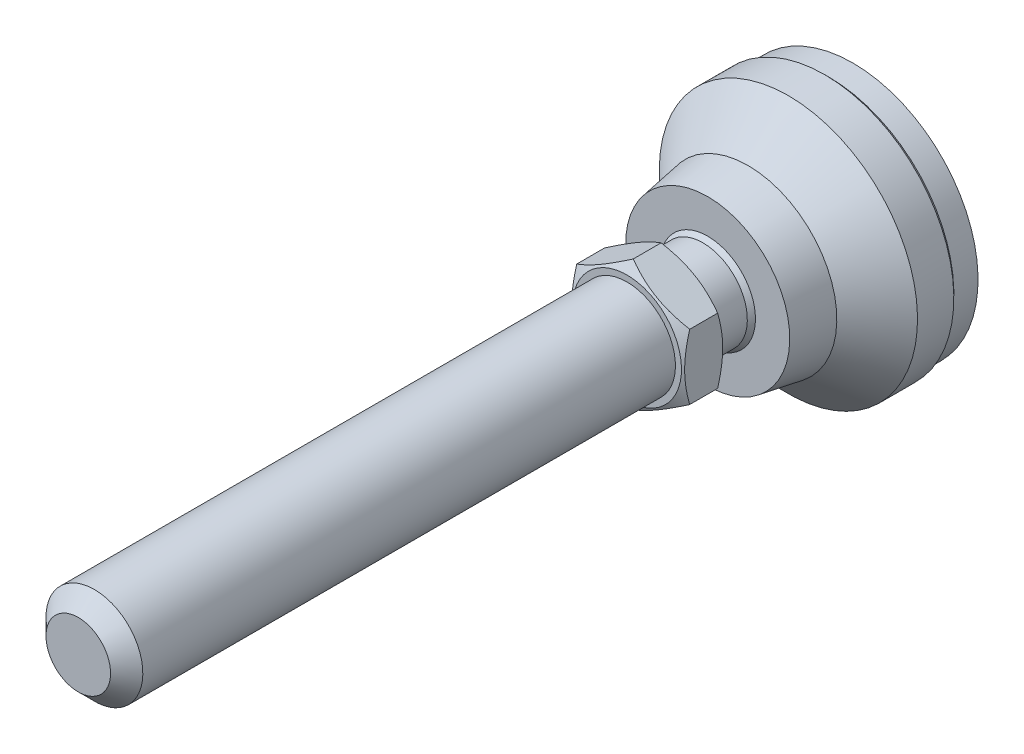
ISO-10303-21;
HEADER;
FILE_DESCRIPTION(('STEP AP214'),'2;1');
FILE_NAME('part.step','',(''),(''),'','','');
FILE_SCHEMA(('AUTOMOTIVE_DESIGN { 1 0 10303 214 1 1 1 1 }'));
ENDSEC;
DATA;
#1=APPLICATION_CONTEXT('core data for automotive mechanical design processes');
#2=APPLICATION_PROTOCOL_DEFINITION('international standard','automotive_design',2000,#1);
#3=PRODUCT_CONTEXT('',#1,'mechanical');
#4=PRODUCT('Part','Part','',(#3));
#5=PRODUCT_RELATED_PRODUCT_CATEGORY('part','',(#4));
#6=PRODUCT_DEFINITION_FORMATION('','',#4);
#7=PRODUCT_DEFINITION_CONTEXT('part definition',#1,'design');
#8=PRODUCT_DEFINITION('design','',#6,#7);
#9=PRODUCT_DEFINITION_SHAPE('','',#8);
#10=(LENGTH_UNIT() NAMED_UNIT(*) SI_UNIT(.MILLI.,.METRE.));
#11=(NAMED_UNIT(*) PLANE_ANGLE_UNIT() SI_UNIT($,.RADIAN.));
#12=(NAMED_UNIT(*) SI_UNIT($,.STERADIAN.) SOLID_ANGLE_UNIT());
#13=UNCERTAINTY_MEASURE_WITH_UNIT(LENGTH_MEASURE(1.E-05),#10,'distance_accuracy_value','');
#14=(GEOMETRIC_REPRESENTATION_CONTEXT(3) GLOBAL_UNCERTAINTY_ASSIGNED_CONTEXT((#13)) GLOBAL_UNIT_ASSIGNED_CONTEXT((#10,
#11,#12)) REPRESENTATION_CONTEXT('',''));
#15=CARTESIAN_POINT('',(0.,0.,0.));
#16=DIRECTION('',(0.,0.,1.));
#17=DIRECTION('',(1.,0.,0.));
#18=AXIS2_PLACEMENT_3D('',#15,#16,#17);
#19=CARTESIAN_POINT('',(0.,0.,3.));
#20=DIRECTION('',(0.,0.,-1.));
#21=DIRECTION('',(0.,1.,0.));
#22=AXIS2_PLACEMENT_3D('',#19,#20,#21);
#23=CYLINDRICAL_SURFACE('',#22,5.50000000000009);
#24=CARTESIAN_POINT('',(0.,0.,22.9999999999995));
#25=DIRECTION('',(0.,0.,-1.));
#26=DIRECTION('',(0.,1.,0.));
#27=AXIS2_PLACEMENT_3D('',#24,#25,#26);
#28=CIRCLE('',#27,5.50000000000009);
#29=CARTESIAN_POINT('',(0.,5.50000000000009,22.9999999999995));
#30=VERTEX_POINT('',#29);
#31=EDGE_CURVE('E112',#30,#30,#28,.T.);
#32=ORIENTED_EDGE('',*,*,#31,.T.);
#33=EDGE_LOOP('',(#32));
#34=FACE_BOUND('',#33,.T.);
#35=CARTESIAN_POINT('',(0.,0.,18.5902313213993));
#36=DIRECTION('',(0.,0.,-1.));
#37=DIRECTION('',(0.,1.,0.));
#38=AXIS2_PLACEMENT_3D('',#35,#36,#37);
#39=CIRCLE('',#38,5.50000000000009);
#40=CARTESIAN_POINT('',(-5.50000000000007,0.,18.5902313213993));
#41=VERTEX_POINT('',#40);
#42=EDGE_CURVE('E284',#41,#41,#39,.T.);
#43=ORIENTED_EDGE('',*,*,#42,.F.);
#44=EDGE_LOOP('',(#43));
#45=FACE_BOUND('',#44,.T.);
#46=ADVANCED_FACE('F14',(#34,#45),#23,.T.);
#47=CARTESIAN_POINT('',(0.,0.,14.2601043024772));
#48=DIRECTION('',(0.,0.,-1.));
#49=DIRECTION('',(-1.,0.,0.));
#50=AXIS2_PLACEMENT_3D('',#47,#48,#49);
#51=SPHERICAL_SURFACE('',#50,7.);
#52=CARTESIAN_POINT('',(0.,0.,18.));
#53=DIRECTION('',(0.,0.,-1.));
#54=DIRECTION('',(0.,1.,0.));
#55=AXIS2_PLACEMENT_3D('',#52,#53,#54);
#56=CIRCLE('',#55,5.91719360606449);
#57=CARTESIAN_POINT('',(-5.91719360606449,0.,18.));
#58=VERTEX_POINT('',#57);
#59=EDGE_CURVE('E115',#58,#58,#56,.T.);
#60=CARTESIAN_POINT('',(-5.50000000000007,0.,18.5902313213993));
#61=CARTESIAN_POINT('',(-5.50465946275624,0.,18.5843130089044));
#62=CARTESIAN_POINT('',(-5.50930937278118,0.,18.5783871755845));
#63=CARTESIAN_POINT('',(-5.51859003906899,0.,18.5665205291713));
#64=CARTESIAN_POINT('',(-5.52322079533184,0.,18.5605797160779));
#65=CARTESIAN_POINT('',(-5.53246310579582,0.,18.5486831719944));
#66=CARTESIAN_POINT('',(-5.53707465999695,0.,18.5427274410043));
#67=CARTESIAN_POINT('',(-5.54627851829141,0.,18.5308011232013));
#68=CARTESIAN_POINT('',(-5.55087082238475,0.,18.5248305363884));
#69=CARTESIAN_POINT('',(-5.56003613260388,0.,18.5128745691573));
#70=CARTESIAN_POINT('',(-5.56460913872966,0.,18.5068891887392));
#71=CARTESIAN_POINT('',(-5.57373580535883,0.,18.4949036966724));
#72=CARTESIAN_POINT('',(-5.57828946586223,0.,18.4889035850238));
#73=CARTESIAN_POINT('',(-5.58737739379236,0.,18.4768886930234));
#74=CARTESIAN_POINT('',(-5.59191166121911,0.,18.4708739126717));
#75=CARTESIAN_POINT('',(-5.60096075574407,0.,18.4588297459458));
#76=CARTESIAN_POINT('',(-5.60547558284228,0.,18.4528003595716));
#77=CARTESIAN_POINT('',(-5.6144857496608,0.,18.4407270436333));
#78=CARTESIAN_POINT('',(-5.61898108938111,0.,18.4346831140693));
#79=CARTESIAN_POINT('',(-5.62795223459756,0.,18.4225807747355));
#80=CARTESIAN_POINT('',(-5.6324280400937,0.,18.4165223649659));
#81=CARTESIAN_POINT('',(-5.64136007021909,0.,18.4043911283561));
#82=CARTESIAN_POINT('',(-5.64581629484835,0.,18.398318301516));
#83=CARTESIAN_POINT('',(-5.65470911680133,0.,18.3861582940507));
#84=CARTESIAN_POINT('',(-5.65914571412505,0.,18.3800711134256));
#85=CARTESIAN_POINT('',(-5.66799923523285,0.,18.3678824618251));
#86=CARTESIAN_POINT('',(-5.67241615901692,0.,18.3617809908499));
#87=CARTESIAN_POINT('',(-5.68123028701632,0.,18.3495638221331));
#88=CARTESIAN_POINT('',(-5.68562749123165,0.,18.3434481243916));
#89=CARTESIAN_POINT('',(-5.69440213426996,0.,18.3312025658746));
#90=CARTESIAN_POINT('',(-5.69877957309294,0.,18.3250727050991));
#91=CARTESIAN_POINT('',(-5.70751463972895,0.,18.3127988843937));
#92=CARTESIAN_POINT('',(-5.71187226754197,0.,18.3066549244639));
#93=CARTESIAN_POINT('',(-5.72056766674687,0.,18.2943529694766));
#94=CARTESIAN_POINT('',(-5.72490543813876,0.,18.2881949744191));
#95=CARTESIAN_POINT('',(-5.73356107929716,0.,18.2758650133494));
#96=CARTESIAN_POINT('',(-5.73787894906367,0.,18.2696930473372));
#97=CARTESIAN_POINT('',(-5.74649474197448,0.,18.2573352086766));
#98=CARTESIAN_POINT('',(-5.75079266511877,0.,18.2511493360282));
#99=CARTESIAN_POINT('',(-5.75936851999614,0.,18.2387637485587));
#100=CARTESIAN_POINT('',(-5.76364645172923,0.,18.2325640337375));
#101=CARTESIAN_POINT('',(-5.77218227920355,0.,18.2201508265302));
#102=CARTESIAN_POINT('',(-5.77644017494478,0.,18.2139373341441));
#103=CARTESIAN_POINT('',(-5.78493588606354,0.,18.2014966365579));
#104=CARTESIAN_POINT('',(-5.78917370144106,0.,18.195269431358));
#105=CARTESIAN_POINT('',(-5.79762920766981,0.,18.1828013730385));
#106=CARTESIAN_POINT('',(-5.80184689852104,0.,18.1765605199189));
#107=CARTESIAN_POINT('',(-5.81026211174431,0.,18.1640652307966));
#108=CARTESIAN_POINT('',(-5.81445963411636,0.,18.1578107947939));
#109=CARTESIAN_POINT('',(-5.82283446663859,0.,18.1452884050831));
#110=CARTESIAN_POINT('',(-5.82701177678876,0.,18.1390204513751));
#111=CARTESIAN_POINT('',(-5.83534614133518,0.,18.1264710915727));
#112=CARTESIAN_POINT('',(-5.83950319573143,0.,18.1201896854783));
#113=CARTESIAN_POINT('',(-5.84779700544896,0.,18.107613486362));
#114=CARTESIAN_POINT('',(-5.85193376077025,0.,18.1013186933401));
#115=CARTESIAN_POINT('',(-5.86018692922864,0.,18.0887157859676));
#116=CARTESIAN_POINT('',(-5.86430334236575,0.,18.082407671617));
#117=CARTESIAN_POINT('',(-5.87251578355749,0.,18.0697781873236));
#118=CARTESIAN_POINT('',(-5.87661181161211,0.,18.063456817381));
#119=CARTESIAN_POINT('',(-5.88478343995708,0.,18.0508008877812));
#120=CARTESIAN_POINT('',(-5.88885904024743,0.,18.044466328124));
#121=CARTESIAN_POINT('',(-5.89698977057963,0.,18.0317840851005));
#122=CARTESIAN_POINT('',(-5.90104490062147,0.,18.0254364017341));
#123=CARTESIAN_POINT('',(-5.909134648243,0.,18.0127279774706));
#124=CARTESIAN_POINT('',(-5.91316926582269,0.,18.0063672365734));
#125=CARTESIAN_POINT('',(-5.91719360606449,0.,18.));
#126=B_SPLINE_CURVE_WITH_KNOTS('',3,(#60,#61,#62,#63,#64,#65,#66,#67,#68,#69,#70,#71,#72,#73,
#74,#75,#76,#77,#78,#79,#80,#81,#82,#83,#84,#85,#86,#87,#88,#89,#90,#91,#92,#93,#94,#95,#96,#97,
#98,#99,#100,#101,#102,#103,#104,#105,#106,#107,#108,#109,#110,#111,#112,#113,#114,#115,#116,
#117,#118,#119,#120,#121,#122,#123,#124,#125),.UNSPECIFIED.,.F.,.F.,(4,2,2,2,2,2,2,2,2,2,2,2,2,
2,2,2,2,2,2,2,2,2,2,2,2,2,2,2,2,2,2,2,4),(0.,0.0225971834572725,0.0451943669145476,
0.067791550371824,0.0903887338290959,0.112985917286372,0.135583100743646,0.158180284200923,
0.180777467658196,0.203374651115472,0.225971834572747,0.24856901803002,0.271166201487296,
0.293763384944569,0.316360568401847,0.338957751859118,0.361554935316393,0.384152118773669,
0.406749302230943,0.429346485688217,0.451943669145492,0.474540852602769,0.49713803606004,
0.519735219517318,0.542332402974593,0.564929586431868,0.587526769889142,0.610123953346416,
0.632721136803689,0.655318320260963,0.67791550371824,0.700512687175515,0.723109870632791),.UNSPECIFIED.);
#127=EDGE_CURVE('BSEAM243',#41,#58,#126,.T.);
#128=ORIENTED_EDGE('',*,*,#42,.T.);
#129=ORIENTED_EDGE('',*,*,#59,.F.);
#130=ORIENTED_EDGE('',*,*,#127,.T.);
#131=ORIENTED_EDGE('',*,*,#127,.F.);
#132=EDGE_LOOP('',(#128,#130,#129,#131));
#133=FACE_BOUND('',#132,.T.);
#134=ADVANCED_FACE('F243',(#133),#51,.T.);
#135=CARTESIAN_POINT('',(0.,0.,3.5));
#136=DIRECTION('',(0.,0.,1.));
#137=DIRECTION('',(0.,-1.,0.));
#138=AXIS2_PLACEMENT_3D('',#135,#136,#137);
#139=CONICAL_SURFACE('',#138,16.,0.785398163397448);
#140=CARTESIAN_POINT('',(0.,0.,3.));
#141=DIRECTION('',(0.,0.,-1.));
#142=DIRECTION('',(0.,1.,0.));
#143=AXIS2_PLACEMENT_3D('',#140,#141,#142);
#144=CIRCLE('',#143,15.5);
#145=CARTESIAN_POINT('',(0.,15.5,3.));
#146=VERTEX_POINT('',#145);
#147=EDGE_CURVE('E85',#146,#146,#144,.T.);
#148=ORIENTED_EDGE('',*,*,#147,.F.);
#149=EDGE_LOOP('',(#148));
#150=FACE_BOUND('',#149,.T.);
#151=CARTESIAN_POINT('',(0.,0.,3.5));
#152=DIRECTION('',(0.,0.,-1.));
#153=DIRECTION('',(0.,1.,0.));
#154=AXIS2_PLACEMENT_3D('',#151,#152,#153);
#155=CIRCLE('',#154,16.);
#156=CARTESIAN_POINT('',(0.,16.,3.5));
#157=VERTEX_POINT('',#156);
#158=EDGE_CURVE('E88',#157,#157,#155,.T.);
#159=ORIENTED_EDGE('',*,*,#158,.T.);
#160=EDGE_LOOP('',(#159));
#161=FACE_BOUND('',#160,.T.);
#162=ADVANCED_FACE('F246',(#150,#161),#139,.T.);
#163=CARTESIAN_POINT('',(0.,0.,3.));
#164=DIRECTION('',(0.,0.,-1.));
#165=DIRECTION('',(0.,1.,0.));
#166=AXIS2_PLACEMENT_3D('',#163,#164,#165);
#167=CYLINDRICAL_SURFACE('',#166,16.);
#168=ORIENTED_EDGE('',*,*,#158,.F.);
#169=EDGE_LOOP('',(#168));
#170=FACE_BOUND('',#169,.T.);
#171=CARTESIAN_POINT('',(0.,0.,8.00000000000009));
#172=DIRECTION('',(0.,0.,-1.));
#173=DIRECTION('',(0.,1.,0.));
#174=AXIS2_PLACEMENT_3D('',#171,#172,#173);
#175=CIRCLE('',#174,16.);
#176=CARTESIAN_POINT('',(0.,16.,8.00000000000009));
#177=VERTEX_POINT('',#176);
#178=EDGE_CURVE('E105',#177,#177,#175,.T.);
#179=ORIENTED_EDGE('',*,*,#178,.T.);
#180=EDGE_LOOP('',(#179));
#181=FACE_BOUND('',#180,.T.);
#182=ADVANCED_FACE('F392',(#170,#181),#167,.T.);
#183=CARTESIAN_POINT('',(0.,0.,13.));
#184=DIRECTION('',(0.,0.,-1.));
#185=DIRECTION('',(0.,1.,0.));
#186=AXIS2_PLACEMENT_3D('',#183,#184,#185);
#187=CONICAL_SURFACE('',#186,11.,0.785398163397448);
#188=ORIENTED_EDGE('',*,*,#178,.F.);
#189=EDGE_LOOP('',(#188));
#190=FACE_BOUND('',#189,.T.);
#191=CARTESIAN_POINT('',(0.,0.,13.));
#192=DIRECTION('',(0.,0.,-1.));
#193=DIRECTION('',(0.,1.,0.));
#194=AXIS2_PLACEMENT_3D('',#191,#192,#193);
#195=CIRCLE('',#194,11.);
#196=CARTESIAN_POINT('',(0.,11.,13.));
#197=VERTEX_POINT('',#196);
#198=EDGE_CURVE('E108',#197,#197,#195,.T.);
#199=ORIENTED_EDGE('',*,*,#198,.T.);
#200=EDGE_LOOP('',(#199));
#201=FACE_BOUND('',#200,.T.);
#202=ADVANCED_FACE('F399',(#190,#201),#187,.T.);
#203=CARTESIAN_POINT('',(0.,0.,19.));
#204=DIRECTION('',(0.,0.,-1.));
#205=DIRECTION('',(0.,1.,0.));
#206=AXIS2_PLACEMENT_3D('',#203,#204,#205);
#207=CONICAL_SURFACE('',#206,10.,0.165148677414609);
#208=ORIENTED_EDGE('',*,*,#198,.F.);
#209=EDGE_LOOP('',(#208));
#210=FACE_BOUND('',#209,.T.);
#211=CARTESIAN_POINT('',(0.,0.,18.));
#212=DIRECTION('',(0.,0.,-1.));
#213=DIRECTION('',(0.,1.,0.));
#214=AXIS2_PLACEMENT_3D('',#211,#212,#213);
#215=CIRCLE('',#214,10.1666666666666);
#216=CARTESIAN_POINT('',(0.,10.1666666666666,18.));
#217=VERTEX_POINT('',#216);
#218=EDGE_CURVE('E93',#217,#217,#215,.T.);
#219=ORIENTED_EDGE('',*,*,#218,.T.);
#220=EDGE_LOOP('',(#219));
#221=FACE_BOUND('',#220,.T.);
#222=ADVANCED_FACE('F241',(#210,#221),#207,.T.);
#223=CARTESIAN_POINT('',(-6.60079601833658,0.,18.));
#224=DIRECTION('',(0.,0.,1.));
#225=DIRECTION('',(0.,-1.,0.));
#226=AXIS2_PLACEMENT_3D('',#223,#224,#225);
#227=PLANE('',#226);
#228=ORIENTED_EDGE('',*,*,#218,.F.);
#229=EDGE_LOOP('',(#228));
#230=FACE_BOUND('',#229,.T.);
#231=ORIENTED_EDGE('',*,*,#59,.T.);
#232=EDGE_LOOP('',(#231));
#233=FACE_BOUND('',#232,.T.);
#234=ADVANCED_FACE('F236',(#230,#233),#227,.T.);
#235=CARTESIAN_POINT('',(0.,-8.08290376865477,22.9999999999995));
#236=DIRECTION('',(0.,0.,-1.));
#237=DIRECTION('',(0.,1.,0.));
#238=AXIS2_PLACEMENT_3D('',#235,#236,#237);
#239=PLANE('',#238);
#240=CARTESIAN_POINT('',(0.,0.,22.9999999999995));
#241=DIRECTION('',(0.,0.,1.));
#242=DIRECTION('',(0.,-1.,0.));
#243=AXIS2_PLACEMENT_3D('',#240,#241,#242);
#244=CIRCLE('',#243,6.75);
#245=CARTESIAN_POINT('',(0.,-6.75,22.9999999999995));
#246=VERTEX_POINT('',#245);
#247=EDGE_CURVE('E80',#246,#246,#244,.T.);
#248=ORIENTED_EDGE('',*,*,#247,.F.);
#249=EDGE_LOOP('',(#248));
#250=FACE_BOUND('',#249,.T.);
#251=ORIENTED_EDGE('',*,*,#31,.F.);
#252=EDGE_LOOP('',(#251));
#253=FACE_BOUND('',#252,.T.);
#254=ADVANCED_FACE('F240',(#250,#253),#239,.T.);
#255=CARTESIAN_POINT('',(0.,0.,0.));
#256=DIRECTION('',(0.,0.,1.));
#257=DIRECTION('',(0.,-1.,0.));
#258=AXIS2_PLACEMENT_3D('',#255,#256,#257);
#259=CYLINDRICAL_SURFACE('',#258,15.5);
#260=CARTESIAN_POINT('',(0.,0.,0.));
#261=DIRECTION('',(0.,0.,-1.));
#262=DIRECTION('',(0.,1.,0.));
#263=AXIS2_PLACEMENT_3D('',#260,#261,#262);
#264=CIRCLE('',#263,15.5);
#265=CARTESIAN_POINT('',(0.,15.5,0.));
#266=VERTEX_POINT('',#265);
#267=EDGE_CURVE('E293',#266,#266,#264,.T.);
#268=ORIENTED_EDGE('',*,*,#267,.F.);
#269=EDGE_LOOP('',(#268));
#270=FACE_BOUND('',#269,.T.);
#271=ORIENTED_EDGE('',*,*,#147,.T.);
#272=EDGE_LOOP('',(#271));
#273=FACE_BOUND('',#272,.T.);
#274=ADVANCED_FACE('F250',(#270,#273),#259,.T.);
#275=CARTESIAN_POINT('',(0.,0.,0.));
#276=DIRECTION('',(0.,0.,-1.));
#277=DIRECTION('',(0.,1.,0.));
#278=AXIS2_PLACEMENT_3D('',#275,#276,#277);
#279=PLANE('',#278);
#280=ORIENTED_EDGE('',*,*,#267,.T.);
#281=EDGE_LOOP('',(#280));
#282=FACE_BOUND('',#281,.T.);
#283=ADVANCED_FACE('F133',(#282),#279,.T.);
#284=CARTESIAN_POINT('',(0.,0.,22.9999999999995));
#285=DIRECTION('',(0.,0.,1.));
#286=DIRECTION('',(0.,-1.,0.));
#287=AXIS2_PLACEMENT_3D('',#284,#285,#286);
#288=CONICAL_SURFACE('',#287,6.75,1.0471975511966);
#289=CARTESIAN_POINT('',(7.0002,-4.04133641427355,23.7696190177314));
#290=CARTESIAN_POINT('',(6.84633209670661,-4.13017208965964,23.7183374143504));
#291=CARTESIAN_POINT('',(6.69189049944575,-4.21933898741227,23.6693831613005));
#292=CARTESIAN_POINT('',(6.38175307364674,-4.3983969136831,23.576770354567));
#293=CARTESIAN_POINT('',(6.22605673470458,-4.4882882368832,23.5331140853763));
#294=CARTESIAN_POINT('',(5.75647483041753,-4.7594014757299,23.4109491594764));
#295=CARTESIAN_POINT('',(5.4407356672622,-4.94169356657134,23.3414631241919));
#296=CARTESIAN_POINT('',(4.96823775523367,-5.21449036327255,23.259982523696));
#297=CARTESIAN_POINT('',(4.81289077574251,-5.30417998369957,23.2367710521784));
#298=CARTESIAN_POINT('',(4.50149488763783,-5.48396448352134,23.1978487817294));
#299=CARTESIAN_POINT('',(4.34544604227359,-5.57405932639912,23.1821373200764));
#300=CARTESIAN_POINT('',(4.03307732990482,-5.75440548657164,23.15861548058));
#301=CARTESIAN_POINT('',(3.87675797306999,-5.84465650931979,23.1507961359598));
#302=CARTESIAN_POINT('',(3.56398349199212,-6.02523694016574,23.1432178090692));
#303=CARTESIAN_POINT('',(3.40752837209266,-6.11556634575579,23.1434585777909));
#304=CARTESIAN_POINT('',(2.97889312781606,-6.36303901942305,23.1551972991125));
#305=CARTESIAN_POINT('',(2.7068533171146,-6.52010127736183,23.1749033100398));
#306=CARTESIAN_POINT('',(2.1645805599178,-6.8331825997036,23.2373910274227));
#307=CARTESIAN_POINT('',(1.89434952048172,-6.98920056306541,23.2801940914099));
#308=CARTESIAN_POINT('',(1.35098545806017,-7.30291195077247,23.3871892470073));
#309=CARTESIAN_POINT('',(1.07792099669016,-7.46056579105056,23.4518346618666));
#310=CARTESIAN_POINT('',(0.535864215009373,-7.77352241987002,23.5985536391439));
#311=CARTESIAN_POINT('',(0.266864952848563,-7.92882921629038,23.6805927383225));
#312=CARTESIAN_POINT('',(-0.000199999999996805,-8.08301923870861,23.7696190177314));
#313=B_SPLINE_CURVE_WITH_KNOTS('',3,(#289,#290,#291,#292,#293,#294,#295,#296,#297,#298,#299,
#300,#301,#302,#303,#304,#305,#306,#307,#308,#309,#310,#311,#312),.UNSPECIFIED.,.F.,.F.,(4,2,2,
2,2,2,2,2,2,2,2,4),(0.,0.554727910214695,1.10969417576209,2.2219327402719,2.76443041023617,
3.30688013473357,3.8487128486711,4.39052882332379,5.33376515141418,6.27787517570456,
7.24292418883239,8.20607866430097),.UNSPECIFIED.);
#314=CARTESIAN_POINT('',(7.,-4.04145188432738,23.7695523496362));
#315=VERTEX_POINT('',#314);
#316=CARTESIAN_POINT('',(0.,-8.08290376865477,23.7695523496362));
#317=VERTEX_POINT('',#316);
#318=EDGE_CURVE('E33',#315,#317,#313,.T.);
#319=ORIENTED_EDGE('',*,*,#318,.T.);
#320=CARTESIAN_POINT('',(0.000200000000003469,-8.0830192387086,23.7696190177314));
#321=CARTESIAN_POINT('',(-0.15366790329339,-7.99418356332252,23.7183374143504));
#322=CARTESIAN_POINT('',(-0.308109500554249,-7.90501666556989,23.6693831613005));
#323=CARTESIAN_POINT('',(-0.618246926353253,-7.72595873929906,23.576770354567));
#324=CARTESIAN_POINT('',(-0.773943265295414,-7.63606741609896,23.5331140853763));
#325=CARTESIAN_POINT('',(-1.24352516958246,-7.36495417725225,23.4109491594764));
#326=CARTESIAN_POINT('',(-1.5592643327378,-7.18266208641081,23.3414631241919));
#327=CARTESIAN_POINT('',(-2.03176224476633,-6.90986528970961,23.259982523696));
#328=CARTESIAN_POINT('',(-2.18710922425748,-6.82017566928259,23.2367710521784));
#329=CARTESIAN_POINT('',(-2.49850511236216,-6.64039116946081,23.1978487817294));
#330=CARTESIAN_POINT('',(-2.65455395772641,-6.55029632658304,23.1821373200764));
#331=CARTESIAN_POINT('',(-2.96692267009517,-6.36995016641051,23.15861548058));
#332=CARTESIAN_POINT('',(-3.12324202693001,-6.27969914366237,23.1507961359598));
#333=CARTESIAN_POINT('',(-3.43601650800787,-6.09911871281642,23.1432178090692));
#334=CARTESIAN_POINT('',(-3.59247162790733,-6.00878930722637,23.1434585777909));
#335=CARTESIAN_POINT('',(-4.02110687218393,-5.76131663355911,23.1551972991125));
#336=CARTESIAN_POINT('',(-4.2931466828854,-5.60425437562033,23.1749033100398));
#337=CARTESIAN_POINT('',(-4.83541944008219,-5.29117305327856,23.2373910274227));
#338=CARTESIAN_POINT('',(-5.10565047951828,-5.13515508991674,23.2801940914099));
#339=CARTESIAN_POINT('',(-5.64901454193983,-4.82144370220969,23.3871892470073));
#340=CARTESIAN_POINT('',(-5.92207900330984,-4.6637898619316,23.4518346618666));
#341=CARTESIAN_POINT('',(-6.46413578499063,-4.35083323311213,23.5985536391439));
#342=CARTESIAN_POINT('',(-6.73313504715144,-4.19552643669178,23.6805927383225));
#343=CARTESIAN_POINT('',(-7.0002,-4.04133641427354,23.7696190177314));
#344=B_SPLINE_CURVE_WITH_KNOTS('',3,(#320,#321,#322,#323,#324,#325,#326,#327,#328,#329,#330,
#331,#332,#333,#334,#335,#336,#337,#338,#339,#340,#341,#342,#343),.UNSPECIFIED.,.F.,.F.,(4,2,2,
2,2,2,2,2,2,2,2,4),(0.,0.554727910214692,1.10969417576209,2.2219327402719,2.76443041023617,
3.30688013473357,3.8487128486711,4.39052882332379,5.33376515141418,6.27787517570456,
7.2429241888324,8.20607866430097),.UNSPECIFIED.);
#345=CARTESIAN_POINT('',(-7.,-4.04145188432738,23.7695523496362));
#346=VERTEX_POINT('',#345);
#347=EDGE_CURVE('E9',#317,#346,#344,.T.);
#348=ORIENTED_EDGE('',*,*,#347,.T.);
#349=CARTESIAN_POINT('',(-7.,10.7941920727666,26.5306395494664));
#350=CARTESIAN_POINT('',(-7.,10.4889658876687,26.3828264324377));
#351=CARTESIAN_POINT('',(-7.,10.1830323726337,26.2364485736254));
#352=CARTESIAN_POINT('',(-7.,9.56937426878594,25.9473718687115));
#353=CARTESIAN_POINT('',(-7.,9.26164940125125,25.8046736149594));
#354=CARTESIAN_POINT('',(-7.,8.64241691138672,25.5230334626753));
#355=CARTESIAN_POINT('',(-7.,8.33089777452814,25.3841167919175));
#356=CARTESIAN_POINT('',(-7.,7.70536012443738,25.112051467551));
#357=CARTESIAN_POINT('',(-7.,7.39134173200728,24.9789025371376));
#358=CARTESIAN_POINT('',(-7.,6.75041422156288,24.7158376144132));
#359=CARTESIAN_POINT('',(-7.,6.42340939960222,24.586153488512));
#360=CARTESIAN_POINT('',(-7.,5.76555212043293,24.3367503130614));
#361=CARTESIAN_POINT('',(-7.,5.43469923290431,24.2170323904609));
#362=CARTESIAN_POINT('',(-7.,4.76925489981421,23.9907500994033));
#363=CARTESIAN_POINT('',(-7.,4.4346727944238,23.8841585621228));
#364=CARTESIAN_POINT('',(-7.,3.76072209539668,23.6875884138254));
#365=CARTESIAN_POINT('',(-7.,3.42135506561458,23.5976045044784));
#366=CARTESIAN_POINT('',(-7.,2.73945472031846,23.4390892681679));
#367=CARTESIAN_POINT('',(-7.,2.39694861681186,23.3704440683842));
#368=CARTESIAN_POINT('',(-7.,1.88012043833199,23.2864832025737));
#369=CARTESIAN_POINT('',(-7.,1.70731970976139,23.2616629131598));
#370=CARTESIAN_POINT('',(-7.,1.36088047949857,23.2188461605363));
#371=CARTESIAN_POINT('',(-7.,1.18724206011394,23.2008490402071));
#372=CARTESIAN_POINT('',(-7.,0.841601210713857,23.1722597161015));
#373=CARTESIAN_POINT('',(-7.,0.669606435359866,23.1615753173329));
#374=CARTESIAN_POINT('',(-7.,0.325319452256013,23.1474850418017));
#375=CARTESIAN_POINT('',(-7.,0.153027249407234,23.144079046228));
#376=CARTESIAN_POINT('',(-7.,-0.191547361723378,23.1446266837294));
#377=CARTESIAN_POINT('',(-7.,-0.363829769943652,23.148580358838));
#378=CARTESIAN_POINT('',(-7.,-0.708076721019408,23.1637517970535));
#379=CARTESIAN_POINT('',(-7.,-0.880041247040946,23.1749699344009));
#380=CARTESIAN_POINT('',(-7.,-1.29521152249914,23.210587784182));
#381=CARTESIAN_POINT('',(-7.,-1.53811882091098,23.2385389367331));
#382=CARTESIAN_POINT('',(-7.,-2.02207836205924,23.3073963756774));
#383=CARTESIAN_POINT('',(-7.,-2.26313034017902,23.348304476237));
#384=CARTESIAN_POINT('',(-7.,-2.98325702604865,23.4882905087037));
#385=CARTESIAN_POINT('',(-7.,-3.45902289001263,23.6046030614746));
#386=CARTESIAN_POINT('',(-7.,-4.17034052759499,23.805640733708));
#387=CARTESIAN_POINT('',(-7.,-4.40959825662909,23.8780018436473));
#388=CARTESIAN_POINT('',(-7.,-4.88578879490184,24.0300754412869));
#389=CARTESIAN_POINT('',(-7.,-5.1227215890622,24.1097879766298));
#390=CARTESIAN_POINT('',(-7.,-5.59433999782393,24.2752991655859));
#391=CARTESIAN_POINT('',(-7.,-5.82902636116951,24.3610957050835));
#392=CARTESIAN_POINT('',(-7.,-6.29646575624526,24.5377818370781));
#393=CARTESIAN_POINT('',(-7.,-6.52921880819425,24.6286713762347));
#394=CARTESIAN_POINT('',(-7.,-7.06838764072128,24.8449292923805));
#395=CARTESIAN_POINT('',(-7.,-7.37415833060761,24.9719027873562));
#396=CARTESIAN_POINT('',(-7.,-7.98318619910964,25.2317577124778));
#397=CARTESIAN_POINT('',(-7.,-8.28644323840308,25.3646394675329));
#398=CARTESIAN_POINT('',(-7.,-8.89089309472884,25.6351524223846));
#399=CARTESIAN_POINT('',(-7.,-9.19208552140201,25.7727844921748));
#400=CARTESIAN_POINT('',(-7.,-9.79269750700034,26.0518706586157));
#401=CARTESIAN_POINT('',(-7.,-10.0921170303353,26.1933248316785));
#402=CARTESIAN_POINT('',(-7.,-10.68975936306,26.4794939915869));
#403=CARTESIAN_POINT('',(-7.,-10.9879806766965,26.6242120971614));
#404=CARTESIAN_POINT('',(-7.,-11.5831581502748,26.9162292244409));
#405=CARTESIAN_POINT('',(-7.,-11.8801142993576,27.0635282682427));
#406=CARTESIAN_POINT('',(-7.,-12.7693083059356,27.5085887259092));
#407=CARTESIAN_POINT('',(-7.,-13.3599450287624,27.8095488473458));
#408=CARTESIAN_POINT('',(-7.,-14.4903809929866,28.3928901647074));
#409=CARTESIAN_POINT('',(-7.,-15.0304234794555,28.6748020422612));
#410=CARTESIAN_POINT('',(-7.,-16.1084941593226,29.2424904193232));
#411=CARTESIAN_POINT('',(-7.,-16.6465222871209,29.528267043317));
#412=CARTESIAN_POINT('',(-7.,-17.7197386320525,30.1020999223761));
#413=CARTESIAN_POINT('',(-7.,-18.2549305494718,30.3901492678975));
#414=CARTESIAN_POINT('',(-7.,-19.3240204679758,30.9685741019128));
#415=CARTESIAN_POINT('',(-7.,-19.857918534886,31.2589494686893));
#416=CARTESIAN_POINT('',(-7.,-20.3913374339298,31.5501965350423));
#417=B_SPLINE_CURVE_WITH_KNOTS('',3,(#349,#350,#351,#352,#353,#354,#355,#356,#357,#358,#359,
#360,#361,#362,#363,#364,#365,#366,#367,#368,#369,#370,#371,#372,#373,#374,#375,#376,#377,#378,
#379,#380,#381,#382,#383,#384,#385,#386,#387,#388,#389,#390,#391,#392,#393,#394,#395,#396,#397,
#398,#399,#400,#401,#402,#403,#404,#405,#406,#407,#408,#409,#410,#411,#412,#413,#414,#415,#416),
.UNSPECIFIED.,.F.,.F.,(4,2,2,2,2,2,2,2,2,2,2,2,2,2,2,2,2,2,2,2,2,2,2,2,2,2,2,2,2,2,2,2,2,4),(0.,
1.01741415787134,2.03499109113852,3.05821263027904,4.08138500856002,5.13660308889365,
6.19194032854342,7.24505516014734,8.29783343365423,9.34489314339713,9.86850208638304,
10.3920605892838,10.9088903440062,11.4257116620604,11.9425359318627,12.4593868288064,
13.1925017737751,13.9257194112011,15.3929936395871,16.1428155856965,16.8926423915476,
17.6422099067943,18.391769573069,19.3849451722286,20.3781754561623,21.3715886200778,
22.3650216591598,23.3594479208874,24.3538827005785,26.3425080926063,28.1700804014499,
29.9977117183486,31.8210611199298,33.6443157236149),.UNSPECIFIED.);
#418=CARTESIAN_POINT('',(-7.,4.04145188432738,23.7695523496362));
#419=VERTEX_POINT('',#418);
#420=EDGE_CURVE('E72',#346,#419,#417,.F.);
#421=ORIENTED_EDGE('',*,*,#420,.T.);
#422=CARTESIAN_POINT('',(-7.0002,4.04133641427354,23.7696190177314));
#423=CARTESIAN_POINT('',(-6.84633209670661,4.13017208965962,23.7183374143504));
#424=CARTESIAN_POINT('',(-6.69189049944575,4.21933898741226,23.6693831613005));
#425=CARTESIAN_POINT('',(-6.38175307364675,4.39839691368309,23.576770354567));
#426=CARTESIAN_POINT('',(-6.22605673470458,4.48828823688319,23.5331140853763));
#427=CARTESIAN_POINT('',(-5.75647483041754,4.75940147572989,23.4109491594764));
#428=CARTESIAN_POINT('',(-5.4407356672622,4.94169356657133,23.3414631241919));
#429=CARTESIAN_POINT('',(-4.96823775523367,5.21449036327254,23.259982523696));
#430=CARTESIAN_POINT('',(-4.81289077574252,5.30417998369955,23.2367710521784));
#431=CARTESIAN_POINT('',(-4.50149488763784,5.48396448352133,23.1978487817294));
#432=CARTESIAN_POINT('',(-4.34544604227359,5.57405932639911,23.1821373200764));
#433=CARTESIAN_POINT('',(-4.03307732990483,5.75440548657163,23.15861548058));
#434=CARTESIAN_POINT('',(-3.87675797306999,5.84465650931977,23.1507961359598));
#435=CARTESIAN_POINT('',(-3.56398349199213,6.02523694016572,23.1432178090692));
#436=CARTESIAN_POINT('',(-3.40752837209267,6.11556634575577,23.1434585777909));
#437=CARTESIAN_POINT('',(-2.97889312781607,6.36303901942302,23.1551972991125));
#438=CARTESIAN_POINT('',(-2.7068533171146,6.52010127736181,23.1749033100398));
#439=CARTESIAN_POINT('',(-2.16458055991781,6.83318259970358,23.2373910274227));
#440=CARTESIAN_POINT('',(-1.89434952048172,6.9892005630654,23.2801940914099));
#441=CARTESIAN_POINT('',(-1.35098545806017,7.30291195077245,23.3871892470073));
#442=CARTESIAN_POINT('',(-1.07792099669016,7.46056579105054,23.4518346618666));
#443=CARTESIAN_POINT('',(-0.535864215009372,7.77352241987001,23.5985536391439));
#444=CARTESIAN_POINT('',(-0.26686495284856,7.92882921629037,23.6805927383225));
#445=CARTESIAN_POINT('',(0.000199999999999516,8.0830192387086,23.7696190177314));
#446=B_SPLINE_CURVE_WITH_KNOTS('',3,(#422,#423,#424,#425,#426,#427,#428,#429,#430,#431,#432,
#433,#434,#435,#436,#437,#438,#439,#440,#441,#442,#443,#444,#445),.UNSPECIFIED.,.F.,.F.,(4,2,2,
2,2,2,2,2,2,2,2,4),(0.,0.554727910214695,1.10969417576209,2.2219327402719,2.76443041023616,
3.30688013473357,3.84871284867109,4.39052882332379,5.33376515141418,6.27787517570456,
7.2429241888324,8.20607866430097),.UNSPECIFIED.);
#447=CARTESIAN_POINT('',(0.,8.08290376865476,23.7695523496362));
#448=VERTEX_POINT('',#447);
#449=EDGE_CURVE('E79',#419,#448,#446,.T.);
#450=ORIENTED_EDGE('',*,*,#449,.T.);
#451=CARTESIAN_POINT('',(-0.000200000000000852,8.0830192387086,23.7696190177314));
#452=CARTESIAN_POINT('',(0.153667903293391,7.99418356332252,23.7183374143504));
#453=CARTESIAN_POINT('',(0.308109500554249,7.90501666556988,23.6693831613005));
#454=CARTESIAN_POINT('',(0.618246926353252,7.72595873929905,23.576770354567));
#455=CARTESIAN_POINT('',(0.773943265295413,7.63606741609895,23.5331140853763));
#456=CARTESIAN_POINT('',(1.24352516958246,7.36495417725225,23.4109491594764));
#457=CARTESIAN_POINT('',(1.5592643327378,7.18266208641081,23.3414631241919));
#458=CARTESIAN_POINT('',(2.03176224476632,6.9098652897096,23.259982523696));
#459=CARTESIAN_POINT('',(2.18710922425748,6.82017566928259,23.2367710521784));
#460=CARTESIAN_POINT('',(2.49850511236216,6.64039116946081,23.1978487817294));
#461=CARTESIAN_POINT('',(2.6545539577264,6.55029632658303,23.1821373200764));
#462=CARTESIAN_POINT('',(2.96692267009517,6.36995016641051,23.15861548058));
#463=CARTESIAN_POINT('',(3.12324202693,6.27969914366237,23.1507961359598));
#464=CARTESIAN_POINT('',(3.43601650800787,6.09911871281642,23.1432178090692));
#465=CARTESIAN_POINT('',(3.59247162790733,6.00878930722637,23.1434585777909));
#466=CARTESIAN_POINT('',(4.02110687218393,5.76131663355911,23.1551972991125));
#467=CARTESIAN_POINT('',(4.29314668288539,5.60425437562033,23.1749033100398));
#468=CARTESIAN_POINT('',(4.83541944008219,5.29117305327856,23.2373910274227));
#469=CARTESIAN_POINT('',(5.10565047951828,5.13515508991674,23.2801940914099));
#470=CARTESIAN_POINT('',(5.64901454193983,4.82144370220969,23.3871892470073));
#471=CARTESIAN_POINT('',(5.92207900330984,4.66378986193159,23.4518346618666));
#472=CARTESIAN_POINT('',(6.46413578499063,4.35083323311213,23.5985536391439));
#473=CARTESIAN_POINT('',(6.73313504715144,4.19552643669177,23.6805927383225));
#474=CARTESIAN_POINT('',(7.0002,4.04133641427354,23.7696190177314));
#475=B_SPLINE_CURVE_WITH_KNOTS('',3,(#451,#452,#453,#454,#455,#456,#457,#458,#459,#460,#461,
#462,#463,#464,#465,#466,#467,#468,#469,#470,#471,#472,#473,#474),.UNSPECIFIED.,.F.,.F.,(4,2,2,
2,2,2,2,2,2,2,2,4),(0.,0.554727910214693,1.10969417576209,2.22193274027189,2.76443041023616,
3.30688013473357,3.84871284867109,4.39052882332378,5.33376515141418,6.27787517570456,
7.2429241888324,8.20607866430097),.UNSPECIFIED.);
#476=CARTESIAN_POINT('',(7.,4.04145188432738,23.7695523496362));
#477=VERTEX_POINT('',#476);
#478=EDGE_CURVE('E194',#448,#477,#475,.T.);
#479=ORIENTED_EDGE('',*,*,#478,.T.);
#480=CARTESIAN_POINT('',(7.,10.7941920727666,26.5306395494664));
#481=CARTESIAN_POINT('',(7.,10.4889658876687,26.3828264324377));
#482=CARTESIAN_POINT('',(7.,10.1830323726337,26.2364485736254));
#483=CARTESIAN_POINT('',(7.,9.56937426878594,25.9473718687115));
#484=CARTESIAN_POINT('',(7.,9.26164940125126,25.8046736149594));
#485=CARTESIAN_POINT('',(7.,8.64241691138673,25.5230334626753));
#486=CARTESIAN_POINT('',(7.,8.33089777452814,25.3841167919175));
#487=CARTESIAN_POINT('',(7.,7.70536012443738,25.112051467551));
#488=CARTESIAN_POINT('',(7.,7.39134173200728,24.9789025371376));
#489=CARTESIAN_POINT('',(7.,6.75041422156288,24.7158376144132));
#490=CARTESIAN_POINT('',(7.,6.42340939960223,24.586153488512));
#491=CARTESIAN_POINT('',(7.,5.76555212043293,24.3367503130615));
#492=CARTESIAN_POINT('',(7.,5.43469923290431,24.2170323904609));
#493=CARTESIAN_POINT('',(7.,4.76925489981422,23.9907500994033));
#494=CARTESIAN_POINT('',(7.,4.43467279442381,23.8841585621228));
#495=CARTESIAN_POINT('',(7.,3.76072209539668,23.6875884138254));
#496=CARTESIAN_POINT('',(7.,3.42135506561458,23.5976045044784));
#497=CARTESIAN_POINT('',(7.,2.73945472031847,23.4390892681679));
#498=CARTESIAN_POINT('',(7.,2.39694861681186,23.3704440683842));
#499=CARTESIAN_POINT('',(7.,1.88012043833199,23.2864832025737));
#500=CARTESIAN_POINT('',(7.,1.70731970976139,23.2616629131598));
#501=CARTESIAN_POINT('',(7.,1.36088047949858,23.2188461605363));
#502=CARTESIAN_POINT('',(7.,1.18724206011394,23.2008490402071));
#503=CARTESIAN_POINT('',(7.,0.841601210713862,23.1722597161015));
#504=CARTESIAN_POINT('',(7.,0.669606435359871,23.1615753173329));
#505=CARTESIAN_POINT('',(7.,0.325319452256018,23.1474850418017));
#506=CARTESIAN_POINT('',(7.,0.15302724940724,23.144079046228));
#507=CARTESIAN_POINT('',(7.,-0.191547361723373,23.1446266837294));
#508=CARTESIAN_POINT('',(7.,-0.363829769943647,23.148580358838));
#509=CARTESIAN_POINT('',(7.,-0.708076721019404,23.1637517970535));
#510=CARTESIAN_POINT('',(7.,-0.880041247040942,23.1749699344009));
#511=CARTESIAN_POINT('',(7.,-1.29521152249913,23.210587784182));
#512=CARTESIAN_POINT('',(7.,-1.53811882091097,23.2385389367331));
#513=CARTESIAN_POINT('',(7.,-2.02207836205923,23.3073963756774));
#514=CARTESIAN_POINT('',(7.,-2.26313034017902,23.348304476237));
#515=CARTESIAN_POINT('',(7.,-2.98325702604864,23.4882905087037));
#516=CARTESIAN_POINT('',(7.,-3.45902289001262,23.6046030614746));
#517=CARTESIAN_POINT('',(7.,-4.17034052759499,23.805640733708));
#518=CARTESIAN_POINT('',(7.,-4.40959825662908,23.8780018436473));
#519=CARTESIAN_POINT('',(7.,-4.88578879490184,24.0300754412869));
#520=CARTESIAN_POINT('',(7.,-5.12272158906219,24.1097879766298));
#521=CARTESIAN_POINT('',(7.,-5.59433999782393,24.2752991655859));
#522=CARTESIAN_POINT('',(7.,-5.8290263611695,24.3610957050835));
#523=CARTESIAN_POINT('',(7.,-6.29646575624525,24.5377818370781));
#524=CARTESIAN_POINT('',(7.,-6.52921880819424,24.6286713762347));
#525=CARTESIAN_POINT('',(7.,-7.06838764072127,24.8449292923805));
#526=CARTESIAN_POINT('',(7.,-7.3741583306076,24.9719027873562));
#527=CARTESIAN_POINT('',(7.,-7.98318619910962,25.2317577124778));
#528=CARTESIAN_POINT('',(7.,-8.28644323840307,25.3646394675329));
#529=CARTESIAN_POINT('',(7.,-8.89089309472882,25.6351524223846));
#530=CARTESIAN_POINT('',(7.,-9.19208552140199,25.7727844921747));
#531=CARTESIAN_POINT('',(7.,-9.79269750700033,26.0518706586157));
#532=CARTESIAN_POINT('',(7.,-10.0921170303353,26.1933248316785));
#533=CARTESIAN_POINT('',(7.,-10.68975936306,26.4794939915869));
#534=CARTESIAN_POINT('',(7.,-10.9879806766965,26.6242120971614));
#535=CARTESIAN_POINT('',(7.,-11.5831581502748,26.9162292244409));
#536=CARTESIAN_POINT('',(7.,-11.8801142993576,27.0635282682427));
#537=CARTESIAN_POINT('',(7.,-12.7693083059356,27.5085887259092));
#538=CARTESIAN_POINT('',(7.,-13.3599450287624,27.8095488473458));
#539=CARTESIAN_POINT('',(7.,-14.4903809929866,28.3928901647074));
#540=CARTESIAN_POINT('',(7.,-15.0304234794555,28.6748020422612));
#541=CARTESIAN_POINT('',(7.,-16.1084941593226,29.2424904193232));
#542=CARTESIAN_POINT('',(7.,-16.6465222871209,29.528267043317));
#543=CARTESIAN_POINT('',(7.,-17.7197386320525,30.1020999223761));
#544=CARTESIAN_POINT('',(7.,-18.2549305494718,30.3901492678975));
#545=CARTESIAN_POINT('',(7.,-19.3240204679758,30.9685741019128));
#546=CARTESIAN_POINT('',(7.,-19.857918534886,31.2589494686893));
#547=CARTESIAN_POINT('',(7.,-20.3913374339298,31.5501965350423));
#548=B_SPLINE_CURVE_WITH_KNOTS('',3,(#480,#481,#482,#483,#484,#485,#486,#487,#488,#489,#490,
#491,#492,#493,#494,#495,#496,#497,#498,#499,#500,#501,#502,#503,#504,#505,#506,#507,#508,#509,
#510,#511,#512,#513,#514,#515,#516,#517,#518,#519,#520,#521,#522,#523,#524,#525,#526,#527,#528,
#529,#530,#531,#532,#533,#534,#535,#536,#537,#538,#539,#540,#541,#542,#543,#544,#545,#546,#547),
.UNSPECIFIED.,.F.,.F.,(4,2,2,2,2,2,2,2,2,2,2,2,2,2,2,2,2,2,2,2,2,2,2,2,2,2,2,2,2,2,2,2,2,4),(0.,
1.01741415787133,2.03499109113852,3.05821263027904,4.08138500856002,5.13660308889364,
6.19194032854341,7.24505516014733,8.29783343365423,9.34489314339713,9.86850208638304,
10.3920605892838,10.9088903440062,11.4257116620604,11.9425359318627,12.4593868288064,
13.1925017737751,13.9257194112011,15.3929936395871,16.1428155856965,16.8926423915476,
17.6422099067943,18.391769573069,19.3849451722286,20.3781754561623,21.3715886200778,
22.3650216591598,23.3594479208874,24.3538827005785,26.3425080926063,28.1700804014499,
29.9977117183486,31.8210611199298,33.644315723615),.UNSPECIFIED.);
#549=EDGE_CURVE('E187',#477,#315,#548,.T.);
#550=ORIENTED_EDGE('',*,*,#549,.T.);
#551=EDGE_LOOP('',(#319,#348,#421,#450,#479,#550));
#552=FACE_BOUND('',#551,.T.);
#553=ORIENTED_EDGE('',*,*,#247,.T.);
#554=EDGE_LOOP('',(#553));
#555=FACE_BOUND('',#554,.T.);
#556=ADVANCED_FACE('F70',(#552,#555),#288,.T.);
#557=CARTESIAN_POINT('',(0.,0.,96.));
#558=DIRECTION('',(0.,0.,-1.));
#559=DIRECTION('',(0.,1.,0.));
#560=AXIS2_PLACEMENT_3D('',#557,#558,#559);
#561=PLANE('',#560);
#562=CARTESIAN_POINT('',(0.,0.,96.));
#563=DIRECTION('',(0.,0.,-1.));
#564=DIRECTION('',(0.,1.,0.));
#565=AXIS2_PLACEMENT_3D('',#562,#563,#564);
#566=CIRCLE('',#565,4.);
#567=CARTESIAN_POINT('',(0.,4.,96.));
#568=VERTEX_POINT('',#567);
#569=EDGE_CURVE('E116',#568,#568,#566,.T.);
#570=ORIENTED_EDGE('',*,*,#569,.F.);
#571=EDGE_LOOP('',(#570));
#572=FACE_BOUND('',#571,.T.);
#573=ADVANCED_FACE('F255',(#572),#561,.F.);
#574=CARTESIAN_POINT('',(0.,0.,96.));
#575=DIRECTION('',(0.,0.,-1.));
#576=DIRECTION('',(0.,1.,0.));
#577=AXIS2_PLACEMENT_3D('',#574,#575,#576);
#578=CONICAL_SURFACE('',#577,4.,0.785398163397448);
#579=CARTESIAN_POINT('',(0.,0.,94.));
#580=DIRECTION('',(0.,0.,-1.));
#581=DIRECTION('',(0.,1.,0.));
#582=AXIS2_PLACEMENT_3D('',#579,#580,#581);
#583=CIRCLE('',#582,6.);
#584=CARTESIAN_POINT('',(0.,6.,94.));
#585=VERTEX_POINT('',#584);
#586=EDGE_CURVE('E291',#585,#585,#583,.T.);
#587=ORIENTED_EDGE('',*,*,#586,.F.);
#588=EDGE_LOOP('',(#587));
#589=FACE_BOUND('',#588,.T.);
#590=ORIENTED_EDGE('',*,*,#569,.T.);
#591=EDGE_LOOP('',(#590));
#592=FACE_BOUND('',#591,.T.);
#593=ADVANCED_FACE('F258',(#589,#592),#578,.T.);
#594=CARTESIAN_POINT('',(0.,0.,3.));
#595=DIRECTION('',(0.,0.,-1.));
#596=DIRECTION('',(0.,1.,0.));
#597=AXIS2_PLACEMENT_3D('',#594,#595,#596);
#598=CYLINDRICAL_SURFACE('',#597,6.);
#599=CARTESIAN_POINT('',(0.,0.,27.9999999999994));
#600=DIRECTION('',(0.,0.,-1.));
#601=DIRECTION('',(0.,1.,0.));
#602=AXIS2_PLACEMENT_3D('',#599,#600,#601);
#603=CIRCLE('',#602,6.);
#604=CARTESIAN_POINT('',(0.,6.,27.9999999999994));
#605=VERTEX_POINT('',#604);
#606=EDGE_CURVE('E111',#605,#605,#603,.F.);
#607=ORIENTED_EDGE('',*,*,#606,.T.);
#608=EDGE_LOOP('',(#607));
#609=FACE_BOUND('',#608,.T.);
#610=ORIENTED_EDGE('',*,*,#586,.T.);
#611=EDGE_LOOP('',(#610));
#612=FACE_BOUND('',#611,.T.);
#613=ADVANCED_FACE('F254',(#609,#612),#598,.T.);
#614=CARTESIAN_POINT('',(-7.,12.1243556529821,27.9999999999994));
#615=DIRECTION('',(0.,0.,-1.));
#616=DIRECTION('',(0.,1.,0.));
#617=AXIS2_PLACEMENT_3D('',#614,#615,#616);
#618=PLANE('',#617);
#619=CARTESIAN_POINT('',(0.,0.,27.9999999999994));
#620=DIRECTION('',(0.,0.,1.));
#621=DIRECTION('',(0.,-1.,0.));
#622=AXIS2_PLACEMENT_3D('',#619,#620,#621);
#623=CIRCLE('',#622,6.75);
#624=CARTESIAN_POINT('',(0.,-6.75,27.9999999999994));
#625=VERTEX_POINT('',#624);
#626=EDGE_CURVE('E204',#625,#625,#623,.T.);
#627=ORIENTED_EDGE('',*,*,#626,.T.);
#628=EDGE_LOOP('',(#627));
#629=FACE_BOUND('',#628,.T.);
#630=ORIENTED_EDGE('',*,*,#606,.F.);
#631=EDGE_LOOP('',(#630));
#632=FACE_BOUND('',#631,.T.);
#633=ADVANCED_FACE('F130',(#629,#632),#618,.F.);
#634=CARTESIAN_POINT('',(0.,0.,26.5419087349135));
#635=DIRECTION('',(0.,0.,-1.));
#636=DIRECTION('',(0.,1.,0.));
#637=AXIS2_PLACEMENT_3D('',#634,#635,#636);
#638=CONICAL_SURFACE('',#637,9.27548815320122,1.0471975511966);
#639=CARTESIAN_POINT('',(-0.00019999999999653,-8.08301923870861,27.2303809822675));
#640=CARTESIAN_POINT('',(0.153667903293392,-7.99418356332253,27.2816625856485));
#641=CARTESIAN_POINT('',(0.30810950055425,-7.9050166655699,27.3306168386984));
#642=CARTESIAN_POINT('',(0.618246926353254,-7.72595873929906,27.4232296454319));
#643=CARTESIAN_POINT('',(0.773943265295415,-7.63606741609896,27.4668859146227));
#644=CARTESIAN_POINT('',(1.24352516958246,-7.36495417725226,27.5890508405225));
#645=CARTESIAN_POINT('',(1.5592643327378,-7.18266208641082,27.6585368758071));
#646=CARTESIAN_POINT('',(2.03176224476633,-6.90986528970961,27.7400174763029));
#647=CARTESIAN_POINT('',(2.18710922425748,-6.8201756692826,27.7632289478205));
#648=CARTESIAN_POINT('',(2.49850511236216,-6.64039116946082,27.8021512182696));
#649=CARTESIAN_POINT('',(2.65455395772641,-6.55029632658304,27.8178626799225));
#650=CARTESIAN_POINT('',(2.96692267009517,-6.36995016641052,27.841384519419));
#651=CARTESIAN_POINT('',(3.12324202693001,-6.27969914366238,27.8492038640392));
#652=CARTESIAN_POINT('',(3.43601650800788,-6.09911871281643,27.8567821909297));
#653=CARTESIAN_POINT('',(3.59247162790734,-6.00878930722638,27.856541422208));
#654=CARTESIAN_POINT('',(4.02110687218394,-5.76131663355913,27.8448027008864));
#655=CARTESIAN_POINT('',(4.2931466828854,-5.60425437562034,27.8250966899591));
#656=CARTESIAN_POINT('',(4.8354194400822,-5.29117305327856,27.7626089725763));
#657=CARTESIAN_POINT('',(5.10565047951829,-5.13515508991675,27.719805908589));
#658=CARTESIAN_POINT('',(5.64901454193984,-4.8214437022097,27.6128107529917));
#659=CARTESIAN_POINT('',(5.92207900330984,-4.6637898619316,27.5481653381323));
#660=CARTESIAN_POINT('',(6.46413578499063,-4.35083323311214,27.401446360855));
#661=CARTESIAN_POINT('',(6.73313504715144,-4.19552643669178,27.3194072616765));
#662=CARTESIAN_POINT('',(7.0002,-4.04133641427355,27.2303809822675));
#663=B_SPLINE_CURVE_WITH_KNOTS('',3,(#639,#640,#641,#642,#643,#644,#645,#646,#647,#648,#649,
#650,#651,#652,#653,#654,#655,#656,#657,#658,#659,#660,#661,#662),.UNSPECIFIED.,.F.,.F.,(4,2,2,
2,2,2,2,2,2,2,2,4),(0.,0.554727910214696,1.10969417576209,2.2219327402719,2.76443041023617,
3.30688013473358,3.8487128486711,4.39052882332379,5.33376515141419,6.27787517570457,
7.2429241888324,8.20607866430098),.UNSPECIFIED.);
#664=CARTESIAN_POINT('',(0.,-8.08290376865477,27.2304476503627));
#665=VERTEX_POINT('',#664);
#666=CARTESIAN_POINT('',(7.,-4.04145188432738,27.2304476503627));
#667=VERTEX_POINT('',#666);
#668=EDGE_CURVE('E171',#665,#667,#663,.T.);
#669=ORIENTED_EDGE('',*,*,#668,.T.);
#670=CARTESIAN_POINT('',(7.,10.7941920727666,24.4693604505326));
#671=CARTESIAN_POINT('',(7.,10.4889658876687,24.6171735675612));
#672=CARTESIAN_POINT('',(7.,10.1830323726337,24.7635514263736));
#673=CARTESIAN_POINT('',(7.,9.56937426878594,25.0526281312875));
#674=CARTESIAN_POINT('',(7.,9.26164940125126,25.1953263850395));
#675=CARTESIAN_POINT('',(7.,8.64241691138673,25.4769665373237));
#676=CARTESIAN_POINT('',(7.,8.33089777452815,25.6158832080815));
#677=CARTESIAN_POINT('',(7.,7.7053601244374,25.8879485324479));
#678=CARTESIAN_POINT('',(7.,7.3913417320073,26.0210974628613));
#679=CARTESIAN_POINT('',(7.,6.7504142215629,26.2841623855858));
#680=CARTESIAN_POINT('',(7.,6.42340939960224,26.413846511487));
#681=CARTESIAN_POINT('',(7.,5.76555212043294,26.6632496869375));
#682=CARTESIAN_POINT('',(7.,5.43469923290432,26.782967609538));
#683=CARTESIAN_POINT('',(7.,4.76925489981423,27.0092499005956));
#684=CARTESIAN_POINT('',(7.,4.43467279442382,27.1158414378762));
#685=CARTESIAN_POINT('',(7.,3.76072209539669,27.3124115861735));
#686=CARTESIAN_POINT('',(7.,3.42135506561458,27.4023954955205));
#687=CARTESIAN_POINT('',(7.,2.73945472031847,27.560910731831));
#688=CARTESIAN_POINT('',(7.,2.39694861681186,27.6295559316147));
#689=CARTESIAN_POINT('',(7.,1.88012043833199,27.7135167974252));
#690=CARTESIAN_POINT('',(7.,1.70731970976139,27.7383370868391));
#691=CARTESIAN_POINT('',(7.,1.36088047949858,27.7811538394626));
#692=CARTESIAN_POINT('',(7.,1.18724206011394,27.7991509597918));
#693=CARTESIAN_POINT('',(7.,0.841601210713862,27.8277402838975));
#694=CARTESIAN_POINT('',(7.,0.669606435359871,27.838424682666));
#695=CARTESIAN_POINT('',(7.,0.325319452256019,27.8525149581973));
#696=CARTESIAN_POINT('',(7.,0.153027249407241,27.8559209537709));
#697=CARTESIAN_POINT('',(7.,-0.191547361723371,27.8553733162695));
#698=CARTESIAN_POINT('',(7.,-0.363829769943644,27.851419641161));
#699=CARTESIAN_POINT('',(7.,-0.708076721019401,27.8362482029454));
#700=CARTESIAN_POINT('',(7.,-0.880041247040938,27.8250300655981));
#701=CARTESIAN_POINT('',(7.,-1.29521152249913,27.789412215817));
#702=CARTESIAN_POINT('',(7.,-1.53811882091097,27.7614610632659));
#703=CARTESIAN_POINT('',(7.,-2.02207836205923,27.6926036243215));
#704=CARTESIAN_POINT('',(7.,-2.26313034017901,27.6516955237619));
#705=CARTESIAN_POINT('',(7.,-2.98325702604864,27.5117094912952));
#706=CARTESIAN_POINT('',(7.,-3.45902289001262,27.3953969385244));
#707=CARTESIAN_POINT('',(7.,-4.17034052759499,27.1943592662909));
#708=CARTESIAN_POINT('',(7.,-4.40959825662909,27.1219981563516));
#709=CARTESIAN_POINT('',(7.,-4.88578879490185,26.969924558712));
#710=CARTESIAN_POINT('',(7.,-5.1227215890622,26.8902120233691));
#711=CARTESIAN_POINT('',(7.,-5.59433999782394,26.724700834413));
#712=CARTESIAN_POINT('',(7.,-5.82902636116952,26.6389042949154));
#713=CARTESIAN_POINT('',(7.,-6.29646575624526,26.4622181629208));
#714=CARTESIAN_POINT('',(7.,-6.52921880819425,26.3713286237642));
#715=CARTESIAN_POINT('',(7.,-7.06838764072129,26.1550707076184));
#716=CARTESIAN_POINT('',(7.,-7.37415833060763,26.0280972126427));
#717=CARTESIAN_POINT('',(7.,-7.98318619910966,25.7682422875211));
#718=CARTESIAN_POINT('',(7.,-8.28644323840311,25.635360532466));
#719=CARTESIAN_POINT('',(7.,-8.89089309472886,25.3648475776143));
#720=CARTESIAN_POINT('',(7.,-9.19208552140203,25.2272155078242));
#721=CARTESIAN_POINT('',(7.,-9.79269750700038,24.9481293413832));
#722=CARTESIAN_POINT('',(7.,-10.0921170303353,24.8066751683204));
#723=CARTESIAN_POINT('',(7.,-10.68975936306,24.520506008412));
#724=CARTESIAN_POINT('',(7.,-10.9879806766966,24.3757879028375));
#725=CARTESIAN_POINT('',(7.,-11.5831581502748,24.083770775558));
#726=CARTESIAN_POINT('',(7.,-11.8801142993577,23.9364717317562));
#727=CARTESIAN_POINT('',(7.,-12.7693083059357,23.4914112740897));
#728=CARTESIAN_POINT('',(7.,-13.3599450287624,23.1904511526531));
#729=CARTESIAN_POINT('',(7.,-14.4903809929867,22.6071098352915));
#730=CARTESIAN_POINT('',(7.,-15.0304234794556,22.3251979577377));
#731=CARTESIAN_POINT('',(7.,-16.1084941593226,21.7575095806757));
#732=CARTESIAN_POINT('',(7.,-16.6465222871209,21.4717329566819));
#733=CARTESIAN_POINT('',(7.,-17.7197386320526,20.8979000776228));
#734=CARTESIAN_POINT('',(7.,-18.2549305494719,20.6098507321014));
#735=CARTESIAN_POINT('',(7.,-19.3240204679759,20.0314258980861));
#736=CARTESIAN_POINT('',(7.,-19.857918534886,19.7410505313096));
#737=CARTESIAN_POINT('',(7.,-20.3913374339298,19.4498034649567));
#738=B_SPLINE_CURVE_WITH_KNOTS('',3,(#670,#671,#672,#673,#674,#675,#676,#677,#678,#679,#680,
#681,#682,#683,#684,#685,#686,#687,#688,#689,#690,#691,#692,#693,#694,#695,#696,#697,#698,#699,
#700,#701,#702,#703,#704,#705,#706,#707,#708,#709,#710,#711,#712,#713,#714,#715,#716,#717,#718,
#719,#720,#721,#722,#723,#724,#725,#726,#727,#728,#729,#730,#731,#732,#733,#734,#735,#736,#737),
.UNSPECIFIED.,.F.,.F.,(4,2,2,2,2,2,2,2,2,2,2,2,2,2,2,2,2,2,2,2,2,2,2,2,2,2,2,2,2,2,2,2,2,4),(0.,
1.01741415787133,2.03499109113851,3.05821263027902,4.08138500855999,5.13660308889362,
6.19194032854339,7.24505516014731,8.29783343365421,9.34489314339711,9.86850208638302,
10.3920605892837,10.9088903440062,11.4257116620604,11.9425359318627,12.4593868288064,
13.1925017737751,13.9257194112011,15.3929936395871,16.1428155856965,16.8926423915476,
17.6422099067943,18.391769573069,19.3849451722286,20.3781754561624,21.3715886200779,
22.3650216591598,23.3594479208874,24.3538827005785,26.3425080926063,28.17008040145,
29.9977117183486,31.8210611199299,33.644315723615),.UNSPECIFIED.);
#739=CARTESIAN_POINT('',(7.,4.04145188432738,27.2304476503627));
#740=VERTEX_POINT('',#739);
#741=EDGE_CURVE('E164',#667,#740,#738,.F.);
#742=ORIENTED_EDGE('',*,*,#741,.T.);
#743=CARTESIAN_POINT('',(7.0002,4.04133641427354,27.2303809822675));
#744=CARTESIAN_POINT('',(6.84633209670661,4.13017208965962,27.2816625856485));
#745=CARTESIAN_POINT('',(6.69189049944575,4.21933898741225,27.3306168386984));
#746=CARTESIAN_POINT('',(6.38175307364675,4.39839691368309,27.4232296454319));
#747=CARTESIAN_POINT('',(6.22605673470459,4.48828823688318,27.4668859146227));
#748=CARTESIAN_POINT('',(5.75647483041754,4.75940147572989,27.5890508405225));
#749=CARTESIAN_POINT('',(5.4407356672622,4.94169356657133,27.6585368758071));
#750=CARTESIAN_POINT('',(4.96823775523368,5.21449036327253,27.7400174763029));
#751=CARTESIAN_POINT('',(4.81289077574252,5.30417998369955,27.7632289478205));
#752=CARTESIAN_POINT('',(4.50149488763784,5.48396448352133,27.8021512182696));
#753=CARTESIAN_POINT('',(4.3454460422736,5.5740593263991,27.8178626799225));
#754=CARTESIAN_POINT('',(4.03307732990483,5.75440548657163,27.841384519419));
#755=CARTESIAN_POINT('',(3.87675797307,5.84465650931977,27.8492038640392));
#756=CARTESIAN_POINT('',(3.56398349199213,6.02523694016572,27.8567821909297));
#757=CARTESIAN_POINT('',(3.40752837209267,6.11556634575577,27.856541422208));
#758=CARTESIAN_POINT('',(2.97889312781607,6.36303901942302,27.8448027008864));
#759=CARTESIAN_POINT('',(2.7068533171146,6.52010127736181,27.8250966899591));
#760=CARTESIAN_POINT('',(2.1645805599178,6.83318259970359,27.7626089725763));
#761=CARTESIAN_POINT('',(1.89434952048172,6.9892005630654,27.719805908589));
#762=CARTESIAN_POINT('',(1.35098545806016,7.30291195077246,27.6128107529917));
#763=CARTESIAN_POINT('',(1.07792099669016,7.46056579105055,27.5481653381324));
#764=CARTESIAN_POINT('',(0.535864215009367,7.77352241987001,27.401446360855));
#765=CARTESIAN_POINT('',(0.266864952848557,7.92882921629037,27.3194072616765));
#766=CARTESIAN_POINT('',(-0.00020000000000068,8.0830192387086,27.2303809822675));
#767=B_SPLINE_CURVE_WITH_KNOTS('',3,(#743,#744,#745,#746,#747,#748,#749,#750,#751,#752,#753,
#754,#755,#756,#757,#758,#759,#760,#761,#762,#763,#764,#765,#766),.UNSPECIFIED.,.F.,.F.,(4,2,2,
2,2,2,2,2,2,2,2,4),(0.,0.554727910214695,1.10969417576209,2.2219327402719,2.76443041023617,
3.30688013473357,3.8487128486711,4.39052882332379,5.33376515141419,6.27787517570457,
7.24292418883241,8.20607866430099),.UNSPECIFIED.);
#768=CARTESIAN_POINT('',(0.,8.08290376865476,27.2304476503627));
#769=VERTEX_POINT('',#768);
#770=EDGE_CURVE('E157',#740,#769,#767,.T.);
#771=ORIENTED_EDGE('',*,*,#770,.T.);
#772=CARTESIAN_POINT('',(0.000199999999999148,8.0830192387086,27.2303809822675));
#773=CARTESIAN_POINT('',(-0.15366790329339,7.99418356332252,27.2816625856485));
#774=CARTESIAN_POINT('',(-0.308109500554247,7.90501666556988,27.3306168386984));
#775=CARTESIAN_POINT('',(-0.618246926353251,7.72595873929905,27.4232296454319));
#776=CARTESIAN_POINT('',(-0.773943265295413,7.63606741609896,27.4668859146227));
#777=CARTESIAN_POINT('',(-1.24352516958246,7.36495417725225,27.5890508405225));
#778=CARTESIAN_POINT('',(-1.5592643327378,7.18266208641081,27.6585368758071));
#779=CARTESIAN_POINT('',(-2.03176224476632,6.9098652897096,27.7400174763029));
#780=CARTESIAN_POINT('',(-2.18710922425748,6.82017566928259,27.7632289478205));
#781=CARTESIAN_POINT('',(-2.49850511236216,6.64039116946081,27.8021512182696));
#782=CARTESIAN_POINT('',(-2.6545539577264,6.55029632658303,27.8178626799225));
#783=CARTESIAN_POINT('',(-2.96692267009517,6.36995016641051,27.841384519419));
#784=CARTESIAN_POINT('',(-3.12324202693,6.27969914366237,27.8492038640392));
#785=CARTESIAN_POINT('',(-3.43601650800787,6.09911871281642,27.8567821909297));
#786=CARTESIAN_POINT('',(-3.59247162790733,6.00878930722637,27.856541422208));
#787=CARTESIAN_POINT('',(-4.02110687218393,5.76131663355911,27.8448027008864));
#788=CARTESIAN_POINT('',(-4.2931466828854,5.60425437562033,27.8250966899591));
#789=CARTESIAN_POINT('',(-4.8354194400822,5.29117305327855,27.7626089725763));
#790=CARTESIAN_POINT('',(-5.10565047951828,5.13515508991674,27.719805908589));
#791=CARTESIAN_POINT('',(-5.64901454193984,4.82144370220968,27.6128107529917));
#792=CARTESIAN_POINT('',(-5.92207900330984,4.66378986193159,27.5481653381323));
#793=CARTESIAN_POINT('',(-6.46413578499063,4.35083323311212,27.401446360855));
#794=CARTESIAN_POINT('',(-6.73313504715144,4.19552643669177,27.3194072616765));
#795=CARTESIAN_POINT('',(-7.0002,4.04133641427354,27.2303809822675));
#796=B_SPLINE_CURVE_WITH_KNOTS('',3,(#772,#773,#774,#775,#776,#777,#778,#779,#780,#781,#782,
#783,#784,#785,#786,#787,#788,#789,#790,#791,#792,#793,#794,#795),.UNSPECIFIED.,.F.,.F.,(4,2,2,
2,2,2,2,2,2,2,2,4),(0.,0.554727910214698,1.1096941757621,2.2219327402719,2.76443041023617,
3.30688013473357,3.8487128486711,4.39052882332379,5.33376515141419,6.27787517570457,
7.24292418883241,8.20607866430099),.UNSPECIFIED.);
#797=CARTESIAN_POINT('',(-7.,4.04145188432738,27.2304476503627));
#798=VERTEX_POINT('',#797);
#799=EDGE_CURVE('E150',#769,#798,#796,.T.);
#800=ORIENTED_EDGE('',*,*,#799,.T.);
#801=CARTESIAN_POINT('',(-7.,10.7941920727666,24.4693604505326));
#802=CARTESIAN_POINT('',(-7.,10.4889658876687,24.6171735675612));
#803=CARTESIAN_POINT('',(-7.,10.1830323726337,24.7635514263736));
#804=CARTESIAN_POINT('',(-7.,9.56937426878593,25.0526281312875));
#805=CARTESIAN_POINT('',(-7.,9.26164940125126,25.1953263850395));
#806=CARTESIAN_POINT('',(-7.,8.64241691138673,25.4769665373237));
#807=CARTESIAN_POINT('',(-7.,8.33089777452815,25.6158832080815));
#808=CARTESIAN_POINT('',(-7.,7.70536012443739,25.8879485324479));
#809=CARTESIAN_POINT('',(-7.,7.39134173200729,26.0210974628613));
#810=CARTESIAN_POINT('',(-7.,6.7504142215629,26.2841623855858));
#811=CARTESIAN_POINT('',(-7.,6.42340939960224,26.413846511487));
#812=CARTESIAN_POINT('',(-7.,5.76555212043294,26.6632496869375));
#813=CARTESIAN_POINT('',(-7.,5.43469923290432,26.782967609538));
#814=CARTESIAN_POINT('',(-7.,4.76925489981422,27.0092499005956));
#815=CARTESIAN_POINT('',(-7.,4.43467279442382,27.1158414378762));
#816=CARTESIAN_POINT('',(-7.,3.76072209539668,27.3124115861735));
#817=CARTESIAN_POINT('',(-7.,3.42135506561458,27.4023954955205));
#818=CARTESIAN_POINT('',(-7.,2.73945472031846,27.560910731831));
#819=CARTESIAN_POINT('',(-7.,2.39694861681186,27.6295559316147));
#820=CARTESIAN_POINT('',(-7.,1.88012043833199,27.7135167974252));
#821=CARTESIAN_POINT('',(-7.,1.70731970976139,27.7383370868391));
#822=CARTESIAN_POINT('',(-7.,1.36088047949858,27.7811538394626));
#823=CARTESIAN_POINT('',(-7.,1.18724206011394,27.7991509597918));
#824=CARTESIAN_POINT('',(-7.,0.841601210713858,27.8277402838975));
#825=CARTESIAN_POINT('',(-7.,0.669606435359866,27.838424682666));
#826=CARTESIAN_POINT('',(-7.,0.325319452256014,27.8525149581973));
#827=CARTESIAN_POINT('',(-7.,0.153027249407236,27.8559209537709));
#828=CARTESIAN_POINT('',(-7.,-0.191547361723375,27.8553733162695));
#829=CARTESIAN_POINT('',(-7.,-0.363829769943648,27.851419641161));
#830=CARTESIAN_POINT('',(-7.,-0.708076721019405,27.8362482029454));
#831=CARTESIAN_POINT('',(-7.,-0.880041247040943,27.8250300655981));
#832=CARTESIAN_POINT('',(-7.,-1.29521152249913,27.789412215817));
#833=CARTESIAN_POINT('',(-7.,-1.53811882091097,27.7614610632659));
#834=CARTESIAN_POINT('',(-7.,-2.02207836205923,27.6926036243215));
#835=CARTESIAN_POINT('',(-7.,-2.26313034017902,27.6516955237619));
#836=CARTESIAN_POINT('',(-7.,-2.98325702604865,27.5117094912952));
#837=CARTESIAN_POINT('',(-7.,-3.45902289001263,27.3953969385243));
#838=CARTESIAN_POINT('',(-7.,-4.170340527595,27.1943592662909));
#839=CARTESIAN_POINT('',(-7.,-4.4095982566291,27.1219981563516));
#840=CARTESIAN_POINT('',(-7.,-4.88578879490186,26.969924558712));
#841=CARTESIAN_POINT('',(-7.,-5.12272158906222,26.8902120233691));
#842=CARTESIAN_POINT('',(-7.,-5.59433999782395,26.724700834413));
#843=CARTESIAN_POINT('',(-7.,-5.82902636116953,26.6389042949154));
#844=CARTESIAN_POINT('',(-7.,-6.29646575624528,26.4622181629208));
#845=CARTESIAN_POINT('',(-7.,-6.52921880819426,26.3713286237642));
#846=CARTESIAN_POINT('',(-7.,-7.0683876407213,26.1550707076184));
#847=CARTESIAN_POINT('',(-7.,-7.37415833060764,26.0280972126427));
#848=CARTESIAN_POINT('',(-7.,-7.98318619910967,25.7682422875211));
#849=CARTESIAN_POINT('',(-7.,-8.28644323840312,25.635360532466));
#850=CARTESIAN_POINT('',(-7.,-8.89089309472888,25.3648475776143));
#851=CARTESIAN_POINT('',(-7.,-9.19208552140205,25.2272155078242));
#852=CARTESIAN_POINT('',(-7.,-9.79269750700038,24.9481293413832));
#853=CARTESIAN_POINT('',(-7.,-10.0921170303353,24.8066751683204));
#854=CARTESIAN_POINT('',(-7.,-10.68975936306,24.520506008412));
#855=CARTESIAN_POINT('',(-7.,-10.9879806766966,24.3757879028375));
#856=CARTESIAN_POINT('',(-7.,-11.5831581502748,24.083770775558));
#857=CARTESIAN_POINT('',(-7.,-11.8801142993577,23.9364717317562));
#858=CARTESIAN_POINT('',(-7.,-12.7693083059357,23.4914112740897));
#859=CARTESIAN_POINT('',(-7.,-13.3599450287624,23.1904511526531));
#860=CARTESIAN_POINT('',(-7.,-14.4903809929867,22.6071098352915));
#861=CARTESIAN_POINT('',(-7.,-15.0304234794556,22.3251979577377));
#862=CARTESIAN_POINT('',(-7.,-16.1084941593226,21.7575095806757));
#863=CARTESIAN_POINT('',(-7.,-16.6465222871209,21.4717329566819));
#864=CARTESIAN_POINT('',(-7.,-17.7197386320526,20.8979000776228));
#865=CARTESIAN_POINT('',(-7.,-18.2549305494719,20.6098507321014));
#866=CARTESIAN_POINT('',(-7.,-19.3240204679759,20.0314258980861));
#867=CARTESIAN_POINT('',(-7.,-19.857918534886,19.7410505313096));
#868=CARTESIAN_POINT('',(-7.,-20.3913374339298,19.4498034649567));
#869=B_SPLINE_CURVE_WITH_KNOTS('',3,(#801,#802,#803,#804,#805,#806,#807,#808,#809,#810,#811,
#812,#813,#814,#815,#816,#817,#818,#819,#820,#821,#822,#823,#824,#825,#826,#827,#828,#829,#830,
#831,#832,#833,#834,#835,#836,#837,#838,#839,#840,#841,#842,#843,#844,#845,#846,#847,#848,#849,
#850,#851,#852,#853,#854,#855,#856,#857,#858,#859,#860,#861,#862,#863,#864,#865,#866,#867,#868),
.UNSPECIFIED.,.F.,.F.,(4,2,2,2,2,2,2,2,2,2,2,2,2,2,2,2,2,2,2,2,2,2,2,2,2,2,2,2,2,2,2,2,2,4),(0.,
1.01741415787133,2.03499109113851,3.05821263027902,4.08138500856,5.13660308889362,
6.19194032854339,7.24505516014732,8.29783343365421,9.34489314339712,9.86850208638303,
10.3920605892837,10.9088903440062,11.4257116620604,11.9425359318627,12.4593868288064,
13.1925017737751,13.9257194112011,15.3929936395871,16.1428155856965,16.8926423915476,
17.6422099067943,18.391769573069,19.3849451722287,20.3781754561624,21.3715886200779,
22.3650216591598,23.3594479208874,24.3538827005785,26.3425080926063,28.17008040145,
29.9977117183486,31.8210611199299,33.644315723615),.UNSPECIFIED.);
#870=CARTESIAN_POINT('',(-7.,-4.04145188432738,27.2304476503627));
#871=VERTEX_POINT('',#870);
#872=EDGE_CURVE('E141',#798,#871,#869,.T.);
#873=ORIENTED_EDGE('',*,*,#872,.T.);
#874=CARTESIAN_POINT('',(-7.0002,-4.04133641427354,27.2303809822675));
#875=CARTESIAN_POINT('',(-6.84633209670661,-4.13017208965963,27.2816625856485));
#876=CARTESIAN_POINT('',(-6.69189049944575,-4.21933898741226,27.3306168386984));
#877=CARTESIAN_POINT('',(-6.38175307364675,-4.39839691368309,27.4232296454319));
#878=CARTESIAN_POINT('',(-6.22605673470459,-4.48828823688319,27.4668859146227));
#879=CARTESIAN_POINT('',(-5.75647483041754,-4.75940147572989,27.5890508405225));
#880=CARTESIAN_POINT('',(-5.4407356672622,-4.94169356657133,27.6585368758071));
#881=CARTESIAN_POINT('',(-4.96823775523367,-5.21449036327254,27.7400174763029));
#882=CARTESIAN_POINT('',(-4.81289077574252,-5.30417998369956,27.7632289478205));
#883=CARTESIAN_POINT('',(-4.50149488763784,-5.48396448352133,27.8021512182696));
#884=CARTESIAN_POINT('',(-4.3454460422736,-5.57405932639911,27.8178626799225));
#885=CARTESIAN_POINT('',(-4.03307732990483,-5.75440548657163,27.841384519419));
#886=CARTESIAN_POINT('',(-3.87675797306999,-5.84465650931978,27.8492038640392));
#887=CARTESIAN_POINT('',(-3.56398349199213,-6.02523694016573,27.8567821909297));
#888=CARTESIAN_POINT('',(-3.40752837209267,-6.11556634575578,27.856541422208));
#889=CARTESIAN_POINT('',(-2.97889312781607,-6.36303901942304,27.8448027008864));
#890=CARTESIAN_POINT('',(-2.7068533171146,-6.52010127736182,27.8250966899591));
#891=CARTESIAN_POINT('',(-2.1645805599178,-6.83318259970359,27.7626089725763));
#892=CARTESIAN_POINT('',(-1.89434952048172,-6.98920056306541,27.719805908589));
#893=CARTESIAN_POINT('',(-1.35098545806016,-7.30291195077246,27.6128107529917));
#894=CARTESIAN_POINT('',(-1.07792099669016,-7.46056579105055,27.5481653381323));
#895=CARTESIAN_POINT('',(-0.535864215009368,-7.77352241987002,27.401446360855));
#896=CARTESIAN_POINT('',(-0.266864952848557,-7.92882921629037,27.3194072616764));
#897=CARTESIAN_POINT('',(0.000200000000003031,-8.0830192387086,27.2303809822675));
#898=B_SPLINE_CURVE_WITH_KNOTS('',3,(#874,#875,#876,#877,#878,#879,#880,#881,#882,#883,#884,
#885,#886,#887,#888,#889,#890,#891,#892,#893,#894,#895,#896,#897),.UNSPECIFIED.,.F.,.F.,(4,2,2,
2,2,2,2,2,2,2,2,4),(0.,0.554727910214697,1.1096941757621,2.2219327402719,2.76443041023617,
3.30688013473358,3.8487128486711,4.39052882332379,5.33376515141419,6.27787517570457,
7.24292418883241,8.20607866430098),.UNSPECIFIED.);
#899=EDGE_CURVE('E27',#871,#665,#898,.T.);
#900=ORIENTED_EDGE('',*,*,#899,.T.);
#901=EDGE_LOOP('',(#669,#742,#771,#800,#873,#900));
#902=FACE_BOUND('',#901,.T.);
#903=ORIENTED_EDGE('',*,*,#626,.F.);
#904=EDGE_LOOP('',(#903));
#905=FACE_BOUND('',#904,.T.);
#906=ADVANCED_FACE('F126',(#902,#905),#638,.T.);
#907=CARTESIAN_POINT('',(-7.,-4.04145188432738,23.9999999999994));
#908=DIRECTION('',(-0.5,-0.866025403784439,0.));
#909=DIRECTION('',(0.866025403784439,-0.5,0.));
#910=AXIS2_PLACEMENT_3D('',#907,#908,#909);
#911=PLANE('',#910);
#912=ORIENTED_EDGE('',*,*,#347,.F.);
#913=DIRECTION('',(0.,0.,1.));
#914=VECTOR('',#913,1.);
#915=CARTESIAN_POINT('',(0.,-8.08290376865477,23.9999999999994));
#916=LINE('',#915,#914);
#917=EDGE_CURVE('E101',#317,#665,#916,.T.);
#918=ORIENTED_EDGE('',*,*,#917,.T.);
#919=ORIENTED_EDGE('',*,*,#899,.F.);
#920=DIRECTION('',(0.,0.,1.));
#921=VECTOR('',#920,1.);
#922=CARTESIAN_POINT('',(-7.,-4.04145188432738,23.9999999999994));
#923=LINE('',#922,#921);
#924=EDGE_CURVE('E41',#346,#871,#923,.T.);
#925=ORIENTED_EDGE('',*,*,#924,.F.);
#926=EDGE_LOOP('',(#912,#918,#919,#925));
#927=FACE_BOUND('',#926,.T.);
#928=ADVANCED_FACE('F83',(#927),#911,.T.);
#929=CARTESIAN_POINT('',(-7.,4.04145188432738,23.9999999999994));
#930=DIRECTION('',(-1.,0.,0.));
#931=DIRECTION('',(0.,-1.,0.));
#932=AXIS2_PLACEMENT_3D('',#929,#930,#931);
#933=PLANE('',#932);
#934=ORIENTED_EDGE('',*,*,#420,.F.);
#935=ORIENTED_EDGE('',*,*,#924,.T.);
#936=ORIENTED_EDGE('',*,*,#872,.F.);
#937=DIRECTION('',(0.,0.,1.));
#938=VECTOR('',#937,1.);
#939=CARTESIAN_POINT('',(-7.,4.04145188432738,23.9999999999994));
#940=LINE('',#939,#938);
#941=EDGE_CURVE('E78',#419,#798,#940,.T.);
#942=ORIENTED_EDGE('',*,*,#941,.F.);
#943=EDGE_LOOP('',(#934,#935,#936,#942));
#944=FACE_BOUND('',#943,.T.);
#945=ADVANCED_FACE('F77',(#944),#933,.T.);
#946=CARTESIAN_POINT('',(0.,8.08290376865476,23.9999999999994));
#947=DIRECTION('',(-0.5,0.866025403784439,0.));
#948=DIRECTION('',(-0.866025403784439,-0.5,0.));
#949=AXIS2_PLACEMENT_3D('',#946,#947,#948);
#950=PLANE('',#949);
#951=ORIENTED_EDGE('',*,*,#449,.F.);
#952=ORIENTED_EDGE('',*,*,#941,.T.);
#953=ORIENTED_EDGE('',*,*,#799,.F.);
#954=DIRECTION('',(0.,0.,1.));
#955=VECTOR('',#954,1.);
#956=CARTESIAN_POINT('',(0.,8.08290376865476,23.9999999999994));
#957=LINE('',#956,#955);
#958=EDGE_CURVE('E90',#448,#769,#957,.T.);
#959=ORIENTED_EDGE('',*,*,#958,.F.);
#960=EDGE_LOOP('',(#951,#952,#953,#959));
#961=FACE_BOUND('',#960,.T.);
#962=ADVANCED_FACE('F219',(#961),#950,.T.);
#963=CARTESIAN_POINT('',(7.,4.04145188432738,23.9999999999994));
#964=DIRECTION('',(0.5,0.866025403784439,0.));
#965=DIRECTION('',(-0.866025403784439,0.5,0.));
#966=AXIS2_PLACEMENT_3D('',#963,#964,#965);
#967=PLANE('',#966);
#968=ORIENTED_EDGE('',*,*,#478,.F.);
#969=ORIENTED_EDGE('',*,*,#958,.T.);
#970=ORIENTED_EDGE('',*,*,#770,.F.);
#971=DIRECTION('',(0.,0.,1.));
#972=VECTOR('',#971,1.);
#973=CARTESIAN_POINT('',(7.,4.04145188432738,23.9999999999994));
#974=LINE('',#973,#972);
#975=EDGE_CURVE('E97',#477,#740,#974,.T.);
#976=ORIENTED_EDGE('',*,*,#975,.F.);
#977=EDGE_LOOP('',(#968,#969,#970,#976));
#978=FACE_BOUND('',#977,.T.);
#979=ADVANCED_FACE('F181',(#978),#967,.T.);
#980=CARTESIAN_POINT('',(7.,-4.04145188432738,23.9999999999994));
#981=DIRECTION('',(1.,0.,0.));
#982=DIRECTION('',(0.,1.,0.));
#983=AXIS2_PLACEMENT_3D('',#980,#981,#982);
#984=PLANE('',#983);
#985=ORIENTED_EDGE('',*,*,#549,.F.);
#986=ORIENTED_EDGE('',*,*,#975,.T.);
#987=ORIENTED_EDGE('',*,*,#741,.F.);
#988=DIRECTION('',(0.,0.,1.));
#989=VECTOR('',#988,1.);
#990=CARTESIAN_POINT('',(7.,-4.04145188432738,23.9999999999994));
#991=LINE('',#990,#989);
#992=EDGE_CURVE('E99',#315,#667,#991,.T.);
#993=ORIENTED_EDGE('',*,*,#992,.F.);
#994=EDGE_LOOP('',(#985,#986,#987,#993));
#995=FACE_BOUND('',#994,.T.);
#996=ADVANCED_FACE('F177',(#995),#984,.T.);
#997=CARTESIAN_POINT('',(0.,-8.08290376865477,23.9999999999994));
#998=DIRECTION('',(0.5,-0.866025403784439,0.));
#999=DIRECTION('',(0.866025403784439,0.5,0.));
#1000=AXIS2_PLACEMENT_3D('',#997,#998,#999);
#1001=PLANE('',#1000);
#1002=ORIENTED_EDGE('',*,*,#318,.F.);
#1003=ORIENTED_EDGE('',*,*,#992,.T.);
#1004=ORIENTED_EDGE('',*,*,#668,.F.);
#1005=ORIENTED_EDGE('',*,*,#917,.F.);
#1006=EDGE_LOOP('',(#1002,#1003,#1004,#1005));
#1007=FACE_BOUND('',#1006,.T.);
#1008=ADVANCED_FACE('F180',(#1007),#1001,.T.);
#1009=CLOSED_SHELL('',(#46,#134,#162,#182,#202,#222,#234,#254,#274,#283,#556,#573,#593,#613,
#633,#906,#928,#945,#962,#979,#996,#1008));
#1010=MANIFOLD_SOLID_BREP('B1',#1009);
#1011=ADVANCED_BREP_SHAPE_REPRESENTATION('',(#18,#1010),#14);
#1012=SHAPE_DEFINITION_REPRESENTATION(#9,#1011);
ENDSEC;
END-ISO-10303-21;
